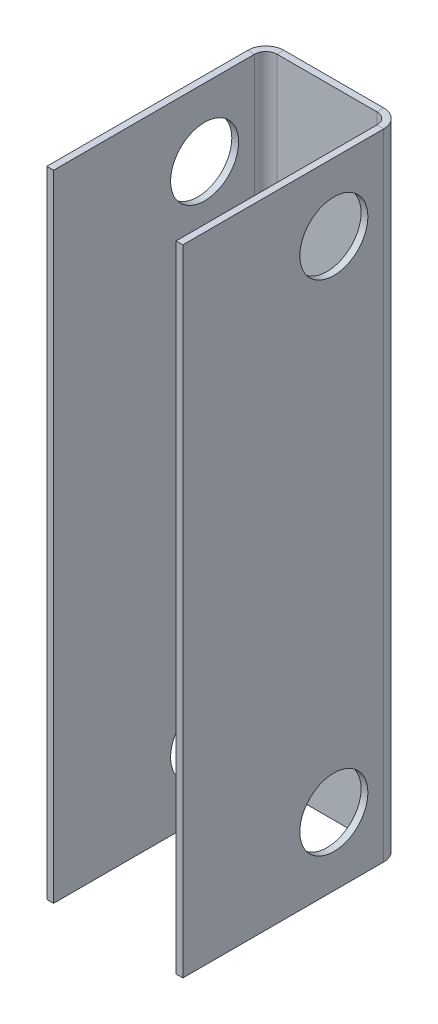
ISO-10303-21;
HEADER;
FILE_DESCRIPTION(('STEP AP214'),'2;1');
FILE_NAME('part.step','',(''),(''),'','','');
FILE_SCHEMA(('AUTOMOTIVE_DESIGN { 1 0 10303 214 1 1 1 1 }'));
ENDSEC;
DATA;
#1=APPLICATION_CONTEXT('core data for automotive mechanical design processes');
#2=APPLICATION_PROTOCOL_DEFINITION('international standard','automotive_design',2000,#1);
#3=PRODUCT_CONTEXT('',#1,'mechanical');
#4=PRODUCT('Part','Part','',(#3));
#5=PRODUCT_RELATED_PRODUCT_CATEGORY('part','',(#4));
#6=PRODUCT_DEFINITION_FORMATION('','',#4);
#7=PRODUCT_DEFINITION_CONTEXT('part definition',#1,'design');
#8=PRODUCT_DEFINITION('design','',#6,#7);
#9=PRODUCT_DEFINITION_SHAPE('','',#8);
#10=(LENGTH_UNIT() NAMED_UNIT(*) SI_UNIT(.MILLI.,.METRE.));
#11=(NAMED_UNIT(*) PLANE_ANGLE_UNIT() SI_UNIT($,.RADIAN.));
#12=(NAMED_UNIT(*) SI_UNIT($,.STERADIAN.) SOLID_ANGLE_UNIT());
#13=UNCERTAINTY_MEASURE_WITH_UNIT(LENGTH_MEASURE(1.E-05),#10,'distance_accuracy_value','');
#14=(GEOMETRIC_REPRESENTATION_CONTEXT(3) GLOBAL_UNCERTAINTY_ASSIGNED_CONTEXT((#13)) GLOBAL_UNIT_ASSIGNED_CONTEXT((#10,
#11,#12)) REPRESENTATION_CONTEXT('',''));
#15=CARTESIAN_POINT('',(0.,0.,0.));
#16=DIRECTION('',(0.,0.,1.));
#17=DIRECTION('',(1.,0.,0.));
#18=AXIS2_PLACEMENT_3D('',#15,#16,#17);
#19=CARTESIAN_POINT('',(0.,280.,0.));
#20=DIRECTION('',(0.,0.,-1.));
#21=DIRECTION('',(-1.,0.,0.));
#22=AXIS2_PLACEMENT_3D('',#19,#20,#21);
#23=PLANE('',#22);
#24=DIRECTION('',(-1.,0.,0.));
#25=VECTOR('',#24,1.);
#26=CARTESIAN_POINT('',(0.,280.,0.));
#27=LINE('',#26,#25);
#28=CARTESIAN_POINT('',(142.,280.,0.));
#29=VERTEX_POINT('',#28);
#30=CARTESIAN_POINT('',(98.,280.,6.85993171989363E-08));
#31=VERTEX_POINT('',#30);
#32=EDGE_CURVE('E58',#29,#31,#27,.T.);
#33=ORIENTED_EDGE('',*,*,#32,.F.);
#34=DIRECTION('',(0.,-1.,0.));
#35=VECTOR('',#34,1.);
#36=CARTESIAN_POINT('',(142.,280.,0.));
#37=LINE('',#36,#35);
#38=CARTESIAN_POINT('',(142.,0.,0.));
#39=VERTEX_POINT('',#38);
#40=EDGE_CURVE('E50',#29,#39,#37,.T.);
#41=ORIENTED_EDGE('',*,*,#40,.T.);
#42=DIRECTION('',(1.,0.,0.));
#43=VECTOR('',#42,1.);
#44=CARTESIAN_POINT('',(0.,0.,0.));
#45=LINE('',#44,#43);
#46=CARTESIAN_POINT('',(98.,0.,0.));
#47=VERTEX_POINT('',#46);
#48=EDGE_CURVE('E66',#47,#39,#45,.T.);
#49=ORIENTED_EDGE('',*,*,#48,.F.);
#50=DIRECTION('',(0.,-1.,0.));
#51=VECTOR('',#50,1.);
#52=CARTESIAN_POINT('',(98.,280.,0.));
#53=LINE('',#52,#51);
#54=EDGE_CURVE('E229',#31,#47,#53,.T.);
#55=ORIENTED_EDGE('',*,*,#54,.F.);
#56=EDGE_LOOP('',(#33,#41,#49,#55));
#57=FACE_BOUND('',#56,.T.);
#58=ADVANCED_FACE('F41',(#57),#23,.T.);
#59=CARTESIAN_POINT('',(0.,280.,3.));
#60=DIRECTION('',(0.,0.,-1.));
#61=DIRECTION('',(-1.,0.,0.));
#62=AXIS2_PLACEMENT_3D('',#59,#60,#61);
#63=PLANE('',#62);
#64=DIRECTION('',(0.,-1.,0.));
#65=VECTOR('',#64,1.);
#66=CARTESIAN_POINT('',(142.,280.,3.));
#67=LINE('',#66,#65);
#68=CARTESIAN_POINT('',(142.,280.,2.9999999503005));
#69=VERTEX_POINT('',#68);
#70=CARTESIAN_POINT('',(142.,0.,3.));
#71=VERTEX_POINT('',#70);
#72=EDGE_CURVE('E233',#69,#71,#67,.T.);
#73=ORIENTED_EDGE('',*,*,#72,.F.);
#74=DIRECTION('',(-1.,0.,0.));
#75=VECTOR('',#74,1.);
#76=CARTESIAN_POINT('',(0.,280.,3.));
#77=LINE('',#76,#75);
#78=CARTESIAN_POINT('',(98.,280.,3.00000003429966));
#79=VERTEX_POINT('',#78);
#80=EDGE_CURVE('E45',#69,#79,#77,.T.);
#81=ORIENTED_EDGE('',*,*,#80,.T.);
#82=DIRECTION('',(0.,-1.,0.));
#83=VECTOR('',#82,1.);
#84=CARTESIAN_POINT('',(98.,280.,3.));
#85=LINE('',#84,#83);
#86=CARTESIAN_POINT('',(98.,0.,3.00000003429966));
#87=VERTEX_POINT('',#86);
#88=EDGE_CURVE('E223',#79,#87,#85,.T.);
#89=ORIENTED_EDGE('',*,*,#88,.T.);
#90=DIRECTION('',(1.,0.,0.));
#91=VECTOR('',#90,1.);
#92=CARTESIAN_POINT('',(0.,0.,3.));
#93=LINE('',#92,#91);
#94=EDGE_CURVE('E241',#87,#71,#93,.T.);
#95=ORIENTED_EDGE('',*,*,#94,.T.);
#96=EDGE_LOOP('',(#73,#81,#89,#95));
#97=FACE_BOUND('',#96,.T.);
#98=ADVANCED_FACE('F246',(#97),#63,.F.);
#99=CARTESIAN_POINT('',(0.,280.,3.));
#100=DIRECTION('',(0.,-1.,0.));
#101=DIRECTION('',(0.,0.,-1.));
#102=AXIS2_PLACEMENT_3D('',#99,#100,#101);
#103=PLANE('',#102);
#104=DIRECTION('',(0.,0.,1.));
#105=VECTOR('',#104,1.);
#106=CARTESIAN_POINT('',(142.,280.,3.));
#107=LINE('',#106,#105);
#108=EDGE_CURVE('E12',#29,#69,#107,.T.);
#109=ORIENTED_EDGE('',*,*,#108,.F.);
#110=ORIENTED_EDGE('',*,*,#32,.T.);
#111=DIRECTION('',(0.,0.,1.));
#112=VECTOR('',#111,1.);
#113=CARTESIAN_POINT('',(98.,280.,3.));
#114=LINE('',#113,#112);
#115=EDGE_CURVE('E226',#31,#79,#114,.T.);
#116=ORIENTED_EDGE('',*,*,#115,.T.);
#117=ORIENTED_EDGE('',*,*,#80,.F.);
#118=EDGE_LOOP('',(#109,#110,#116,#117));
#119=FACE_BOUND('',#118,.T.);
#120=ADVANCED_FACE('F43',(#119),#103,.F.);
#121=CARTESIAN_POINT('',(0.,0.,3.));
#122=DIRECTION('',(0.,1.,0.));
#123=DIRECTION('',(0.,0.,1.));
#124=AXIS2_PLACEMENT_3D('',#121,#122,#123);
#125=PLANE('',#124);
#126=DIRECTION('',(0.,0.,-1.));
#127=VECTOR('',#126,1.);
#128=CARTESIAN_POINT('',(142.,0.,3.));
#129=LINE('',#128,#127);
#130=EDGE_CURVE('E236',#71,#39,#129,.T.);
#131=ORIENTED_EDGE('',*,*,#130,.F.);
#132=ORIENTED_EDGE('',*,*,#94,.F.);
#133=DIRECTION('',(0.,0.,-1.));
#134=VECTOR('',#133,1.);
#135=CARTESIAN_POINT('',(98.,0.,3.));
#136=LINE('',#135,#134);
#137=EDGE_CURVE('E231',#87,#47,#136,.T.);
#138=ORIENTED_EDGE('',*,*,#137,.T.);
#139=ORIENTED_EDGE('',*,*,#48,.T.);
#140=EDGE_LOOP('',(#131,#132,#138,#139));
#141=FACE_BOUND('',#140,.T.);
#142=ADVANCED_FACE('F287',(#141),#125,.F.);
#143=CARTESIAN_POINT('',(98.,280.,7.99999993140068));
#144=DIRECTION('',(0.,-1.,0.));
#145=DIRECTION('',(0.,0.,-1.));
#146=AXIS2_PLACEMENT_3D('',#143,#144,#145);
#147=PLANE('',#146);
#148=ORIENTED_EDGE('',*,*,#115,.F.);
#149=CARTESIAN_POINT('',(98.,280.,8.));
#150=DIRECTION('',(0.,-1.,0.));
#151=DIRECTION('',(1.,0.,0.));
#152=AXIS2_PLACEMENT_3D('',#149,#150,#151);
#153=CIRCLE('',#152,7.99999993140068);
#154=CARTESIAN_POINT('',(90.,280.,8.00000000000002));
#155=VERTEX_POINT('',#154);
#156=EDGE_CURVE('E181',#31,#155,#153,.F.);
#157=ORIENTED_EDGE('',*,*,#156,.T.);
#158=DIRECTION('',(1.,0.,0.));
#159=VECTOR('',#158,1.);
#160=CARTESIAN_POINT('',(93.,280.,8.00000000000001));
#161=LINE('',#160,#159);
#162=CARTESIAN_POINT('',(93.,280.,7.99999999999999));
#163=VERTEX_POINT('',#162);
#164=EDGE_CURVE('E204',#155,#163,#161,.T.);
#165=ORIENTED_EDGE('',*,*,#164,.T.);
#166=CARTESIAN_POINT('',(98.,280.,7.99999993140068));
#167=DIRECTION('',(0.,1.,0.));
#168=DIRECTION('',(0.,0.,1.));
#169=AXIS2_PLACEMENT_3D('',#166,#167,#168);
#170=CIRCLE('',#169,4.99999989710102);
#171=EDGE_CURVE('E215',#79,#163,#170,.T.);
#172=ORIENTED_EDGE('',*,*,#171,.F.);
#173=EDGE_LOOP('',(#148,#157,#165,#172));
#174=FACE_BOUND('',#173,.T.);
#175=ADVANCED_FACE('F251',(#174),#147,.F.);
#176=CARTESIAN_POINT('',(98.,0.,7.99999993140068));
#177=DIRECTION('',(0.,1.,0.));
#178=DIRECTION('',(-1.,0.,0.));
#179=AXIS2_PLACEMENT_3D('',#176,#177,#178);
#180=PLANE('',#179);
#181=DIRECTION('',(-1.,0.,0.));
#182=VECTOR('',#181,1.);
#183=CARTESIAN_POINT('',(93.,0.,8.00000000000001));
#184=LINE('',#183,#182);
#185=CARTESIAN_POINT('',(93.0000000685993,0.,8.00000000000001));
#186=VERTEX_POINT('',#185);
#187=CARTESIAN_POINT('',(90.,0.,8.00000000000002));
#188=VERTEX_POINT('',#187);
#189=EDGE_CURVE('E207',#186,#188,#184,.T.);
#190=ORIENTED_EDGE('',*,*,#189,.T.);
#191=CARTESIAN_POINT('',(98.,0.,8.));
#192=DIRECTION('',(0.,-1.,0.));
#193=DIRECTION('',(1.,0.,0.));
#194=AXIS2_PLACEMENT_3D('',#191,#192,#193);
#195=CIRCLE('',#194,7.99999993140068);
#196=EDGE_CURVE('E212',#188,#47,#195,.T.);
#197=ORIENTED_EDGE('',*,*,#196,.T.);
#198=ORIENTED_EDGE('',*,*,#137,.F.);
#199=CARTESIAN_POINT('',(98.,0.,7.99999993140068));
#200=DIRECTION('',(0.,-1.,0.));
#201=DIRECTION('',(1.,0.,0.));
#202=AXIS2_PLACEMENT_3D('',#199,#200,#201);
#203=CIRCLE('',#202,4.99999989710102);
#204=EDGE_CURVE('E220',#186,#87,#203,.T.);
#205=ORIENTED_EDGE('',*,*,#204,.F.);
#206=EDGE_LOOP('',(#190,#197,#198,#205));
#207=FACE_BOUND('',#206,.T.);
#208=ADVANCED_FACE('F262',(#207),#180,.F.);
#209=CARTESIAN_POINT('',(98.,420.174107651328,8.));
#210=DIRECTION('',(0.,-1.,0.));
#211=DIRECTION('',(1.,0.,0.));
#212=AXIS2_PLACEMENT_3D('',#209,#210,#211);
#213=CYLINDRICAL_SURFACE('',#212,4.99999993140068);
#214=ORIENTED_EDGE('',*,*,#204,.T.);
#215=ORIENTED_EDGE('',*,*,#88,.F.);
#216=ORIENTED_EDGE('',*,*,#171,.T.);
#217=DIRECTION('',(0.,-1.,0.));
#218=VECTOR('',#217,1.);
#219=CARTESIAN_POINT('',(93.,280.,8.00000000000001));
#220=LINE('',#219,#218);
#221=EDGE_CURVE('E178',#163,#186,#220,.T.);
#222=ORIENTED_EDGE('',*,*,#221,.T.);
#223=EDGE_LOOP('',(#214,#215,#216,#222));
#224=FACE_BOUND('',#223,.T.);
#225=ADVANCED_FACE('F271',(#224),#213,.F.);
#226=CARTESIAN_POINT('',(98.,420.174107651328,8.));
#227=DIRECTION('',(0.,-1.,0.));
#228=DIRECTION('',(1.,0.,0.));
#229=AXIS2_PLACEMENT_3D('',#226,#227,#228);
#230=CYLINDRICAL_SURFACE('',#229,7.99999993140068);
#231=ORIENTED_EDGE('',*,*,#196,.F.);
#232=DIRECTION('',(0.,-1.,0.));
#233=VECTOR('',#232,1.);
#234=CARTESIAN_POINT('',(90.,280.,8.00000000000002));
#235=LINE('',#234,#233);
#236=EDGE_CURVE('E185',#155,#188,#235,.T.);
#237=ORIENTED_EDGE('',*,*,#236,.F.);
#238=ORIENTED_EDGE('',*,*,#156,.F.);
#239=ORIENTED_EDGE('',*,*,#54,.T.);
#240=EDGE_LOOP('',(#231,#237,#238,#239));
#241=FACE_BOUND('',#240,.T.);
#242=ADVANCED_FACE('F255',(#241),#230,.T.);
#243=CARTESIAN_POINT('',(93.0000000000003,0.,96.5909300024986));
#244=DIRECTION('',(0.,0.,-1.));
#245=DIRECTION('',(-1.,0.,0.));
#246=AXIS2_PLACEMENT_3D('',#243,#244,#245);
#247=PLANE('',#246);
#248=DIRECTION('',(0.,-1.,0.));
#249=VECTOR('',#248,1.);
#250=CARTESIAN_POINT('',(90.0000000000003,0.,96.5909300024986));
#251=LINE('',#250,#249);
#252=CARTESIAN_POINT('',(90.0000000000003,280.,96.5909300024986));
#253=VERTEX_POINT('',#252);
#254=CARTESIAN_POINT('',(90.0000000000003,0.,96.5909300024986));
#255=VERTEX_POINT('',#254);
#256=EDGE_CURVE('E201',#253,#255,#251,.T.);
#257=ORIENTED_EDGE('',*,*,#256,.T.);
#258=DIRECTION('',(-1.,0.,0.));
#259=VECTOR('',#258,1.);
#260=CARTESIAN_POINT('',(93.0000000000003,0.,96.5909300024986));
#261=LINE('',#260,#259);
#262=CARTESIAN_POINT('',(93.0000000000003,0.,96.5909300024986));
#263=VERTEX_POINT('',#262);
#264=EDGE_CURVE('E182',#263,#255,#261,.T.);
#265=ORIENTED_EDGE('',*,*,#264,.F.);
#266=DIRECTION('',(0.,-1.,0.));
#267=VECTOR('',#266,1.);
#268=CARTESIAN_POINT('',(93.0000000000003,0.,96.5909300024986));
#269=LINE('',#268,#267);
#270=CARTESIAN_POINT('',(93.0000000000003,280.,96.5909300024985));
#271=VERTEX_POINT('',#270);
#272=EDGE_CURVE('E193',#271,#263,#269,.T.);
#273=ORIENTED_EDGE('',*,*,#272,.F.);
#274=DIRECTION('',(-1.,0.,0.));
#275=VECTOR('',#274,1.);
#276=CARTESIAN_POINT('',(93.0000000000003,280.,96.5909300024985));
#277=LINE('',#276,#275);
#278=EDGE_CURVE('E198',#271,#253,#277,.T.);
#279=ORIENTED_EDGE('',*,*,#278,.T.);
#280=EDGE_LOOP('',(#257,#265,#273,#279));
#281=FACE_BOUND('',#280,.T.);
#282=ADVANCED_FACE('F278',(#281),#247,.F.);
#283=CARTESIAN_POINT('',(93.0000000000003,280.,96.5909300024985));
#284=DIRECTION('',(-1.,0.,0.));
#285=DIRECTION('',(0.,0.,1.));
#286=AXIS2_PLACEMENT_3D('',#283,#284,#285);
#287=PLANE('',#286);
#288=CARTESIAN_POINT('',(93.,250.,29.9999999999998));
#289=DIRECTION('',(-1.,0.,0.));
#290=DIRECTION('',(0.,0.,1.));
#291=AXIS2_PLACEMENT_3D('',#288,#289,#290);
#292=CIRCLE('',#291,15.);
#293=CARTESIAN_POINT('',(93.0000000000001,250.,44.9999999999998));
#294=VERTEX_POINT('',#293);
#295=EDGE_CURVE('E512',#294,#294,#292,.T.);
#296=ORIENTED_EDGE('',*,*,#295,.T.);
#297=EDGE_LOOP('',(#296));
#298=FACE_BOUND('',#297,.T.);
#299=CARTESIAN_POINT('',(93.0000000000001,30.,29.9999999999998));
#300=DIRECTION('',(-1.,0.,0.));
#301=DIRECTION('',(0.,0.,1.));
#302=AXIS2_PLACEMENT_3D('',#299,#300,#301);
#303=CIRCLE('',#302,15.);
#304=CARTESIAN_POINT('',(93.0000000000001,30.,44.9999999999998));
#305=VERTEX_POINT('',#304);
#306=EDGE_CURVE('E161',#305,#305,#303,.T.);
#307=ORIENTED_EDGE('',*,*,#306,.T.);
#308=EDGE_LOOP('',(#307));
#309=FACE_BOUND('',#308,.T.);
#310=ORIENTED_EDGE('',*,*,#221,.F.);
#311=DIRECTION('',(0.,0.,1.));
#312=VECTOR('',#311,1.);
#313=CARTESIAN_POINT('',(93.0000000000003,280.,96.5909300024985));
#314=LINE('',#313,#312);
#315=EDGE_CURVE('E196',#163,#271,#314,.T.);
#316=ORIENTED_EDGE('',*,*,#315,.T.);
#317=ORIENTED_EDGE('',*,*,#272,.T.);
#318=DIRECTION('',(0.,0.,-1.));
#319=VECTOR('',#318,1.);
#320=CARTESIAN_POINT('',(93.0000000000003,0.,96.5909300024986));
#321=LINE('',#320,#319);
#322=EDGE_CURVE('E190',#263,#186,#321,.T.);
#323=ORIENTED_EDGE('',*,*,#322,.T.);
#324=EDGE_LOOP('',(#310,#316,#317,#323));
#325=FACE_BOUND('',#324,.T.);
#326=ADVANCED_FACE('F266',(#298,#309,#325),#287,.F.);
#327=CARTESIAN_POINT('',(93.0000000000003,280.,96.5909300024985));
#328=DIRECTION('',(0.,-1.,0.));
#329=DIRECTION('',(-1.,0.,0.));
#330=AXIS2_PLACEMENT_3D('',#327,#328,#329);
#331=PLANE('',#330);
#332=ORIENTED_EDGE('',*,*,#164,.F.);
#333=DIRECTION('',(0.,0.,1.));
#334=VECTOR('',#333,1.);
#335=CARTESIAN_POINT('',(90.0000000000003,280.,96.5909300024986));
#336=LINE('',#335,#334);
#337=EDGE_CURVE('E188',#155,#253,#336,.T.);
#338=ORIENTED_EDGE('',*,*,#337,.T.);
#339=ORIENTED_EDGE('',*,*,#278,.F.);
#340=ORIENTED_EDGE('',*,*,#315,.F.);
#341=EDGE_LOOP('',(#332,#338,#339,#340));
#342=FACE_BOUND('',#341,.T.);
#343=ADVANCED_FACE('F332',(#342),#331,.F.);
#344=CARTESIAN_POINT('',(90.0000000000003,280.,96.5909300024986));
#345=DIRECTION('',(-1.,0.,0.));
#346=DIRECTION('',(0.,0.,1.));
#347=AXIS2_PLACEMENT_3D('',#344,#345,#346);
#348=PLANE('',#347);
#349=CARTESIAN_POINT('',(89.9999999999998,250.,29.9999999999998));
#350=DIRECTION('',(1.,0.,0.));
#351=DIRECTION('',(0.,0.,-1.));
#352=AXIS2_PLACEMENT_3D('',#349,#350,#351);
#353=CIRCLE('',#352,15.);
#354=CARTESIAN_POINT('',(89.9999999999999,250.,14.9999999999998));
#355=VERTEX_POINT('',#354);
#356=EDGE_CURVE('E509',#355,#355,#353,.T.);
#357=ORIENTED_EDGE('',*,*,#356,.T.);
#358=EDGE_LOOP('',(#357));
#359=FACE_BOUND('',#358,.T.);
#360=CARTESIAN_POINT('',(89.9999999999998,30.,29.9999999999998));
#361=DIRECTION('',(1.,0.,0.));
#362=DIRECTION('',(0.,0.,-1.));
#363=AXIS2_PLACEMENT_3D('',#360,#361,#362);
#364=CIRCLE('',#363,15.);
#365=CARTESIAN_POINT('',(89.9999999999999,30.,14.9999999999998));
#366=VERTEX_POINT('',#365);
#367=EDGE_CURVE('E517',#366,#366,#364,.T.);
#368=ORIENTED_EDGE('',*,*,#367,.T.);
#369=EDGE_LOOP('',(#368));
#370=FACE_BOUND('',#369,.T.);
#371=ORIENTED_EDGE('',*,*,#337,.F.);
#372=ORIENTED_EDGE('',*,*,#236,.T.);
#373=DIRECTION('',(0.,0.,-1.));
#374=VECTOR('',#373,1.);
#375=CARTESIAN_POINT('',(90.0000000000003,0.,96.5909300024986));
#376=LINE('',#375,#374);
#377=EDGE_CURVE('E179',#255,#188,#376,.T.);
#378=ORIENTED_EDGE('',*,*,#377,.F.);
#379=ORIENTED_EDGE('',*,*,#256,.F.);
#380=EDGE_LOOP('',(#371,#372,#378,#379));
#381=FACE_BOUND('',#380,.T.);
#382=ADVANCED_FACE('F257',(#359,#370,#381),#348,.T.);
#383=CARTESIAN_POINT('',(93.0000000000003,0.,96.5909300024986));
#384=DIRECTION('',(0.,1.,0.));
#385=DIRECTION('',(1.,0.,0.));
#386=AXIS2_PLACEMENT_3D('',#383,#384,#385);
#387=PLANE('',#386);
#388=ORIENTED_EDGE('',*,*,#189,.F.);
#389=ORIENTED_EDGE('',*,*,#322,.F.);
#390=ORIENTED_EDGE('',*,*,#264,.T.);
#391=ORIENTED_EDGE('',*,*,#377,.T.);
#392=EDGE_LOOP('',(#388,#389,#390,#391));
#393=FACE_BOUND('',#392,.T.);
#394=ADVANCED_FACE('F264',(#393),#387,.F.);
#395=CARTESIAN_POINT('',(142.,280.,8.00000009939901));
#396=DIRECTION('',(0.,-1.,0.));
#397=DIRECTION('',(0.,0.,-1.));
#398=AXIS2_PLACEMENT_3D('',#395,#396,#397);
#399=PLANE('',#398);
#400=DIRECTION('',(-1.,0.,0.));
#401=VECTOR('',#400,1.);
#402=CARTESIAN_POINT('',(147.,280.,8.00000000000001));
#403=LINE('',#402,#401);
#404=CARTESIAN_POINT('',(150.,280.,8.00000000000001));
#405=VERTEX_POINT('',#404);
#406=CARTESIAN_POINT('',(147.000000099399,280.,8.00000000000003));
#407=VERTEX_POINT('',#406);
#408=EDGE_CURVE('E531',#405,#407,#403,.T.);
#409=ORIENTED_EDGE('',*,*,#408,.F.);
#410=CARTESIAN_POINT('',(142.,280.,8.));
#411=DIRECTION('',(0.,1.,0.));
#412=DIRECTION('',(-1.,0.,0.));
#413=AXIS2_PLACEMENT_3D('',#410,#411,#412);
#414=CIRCLE('',#413,8.00000009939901);
#415=EDGE_CURVE('E165',#405,#29,#414,.T.);
#416=ORIENTED_EDGE('',*,*,#415,.T.);
#417=ORIENTED_EDGE('',*,*,#108,.T.);
#418=CARTESIAN_POINT('',(142.,280.,8.00000009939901));
#419=DIRECTION('',(0.,1.,0.));
#420=DIRECTION('',(0.,0.,1.));
#421=AXIS2_PLACEMENT_3D('',#418,#419,#420);
#422=CIRCLE('',#421,5.00000014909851);
#423=EDGE_CURVE('E172',#407,#69,#422,.T.);
#424=ORIENTED_EDGE('',*,*,#423,.F.);
#425=EDGE_LOOP('',(#409,#416,#417,#424));
#426=FACE_BOUND('',#425,.T.);
#427=ADVANCED_FACE('F347',(#426),#399,.F.);
#428=CARTESIAN_POINT('',(142.,0.,8.00000009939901));
#429=DIRECTION('',(0.,1.,0.));
#430=DIRECTION('',(-1.,0.,0.));
#431=AXIS2_PLACEMENT_3D('',#428,#429,#430);
#432=PLANE('',#431);
#433=CARTESIAN_POINT('',(142.,0.,8.));
#434=DIRECTION('',(0.,1.,0.));
#435=DIRECTION('',(-1.,0.,0.));
#436=AXIS2_PLACEMENT_3D('',#433,#434,#435);
#437=CIRCLE('',#436,8.00000009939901);
#438=CARTESIAN_POINT('',(150.,0.,7.99999999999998));
#439=VERTEX_POINT('',#438);
#440=EDGE_CURVE('E168',#39,#439,#437,.F.);
#441=ORIENTED_EDGE('',*,*,#440,.T.);
#442=DIRECTION('',(1.,0.,0.));
#443=VECTOR('',#442,1.);
#444=CARTESIAN_POINT('',(147.,0.,8.00000000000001));
#445=LINE('',#444,#443);
#446=CARTESIAN_POINT('',(147.,0.,7.99999999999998));
#447=VERTEX_POINT('',#446);
#448=EDGE_CURVE('E142',#447,#439,#445,.T.);
#449=ORIENTED_EDGE('',*,*,#448,.F.);
#450=CARTESIAN_POINT('',(142.,0.,8.00000009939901));
#451=DIRECTION('',(0.,-1.,0.));
#452=DIRECTION('',(1.,0.,0.));
#453=AXIS2_PLACEMENT_3D('',#450,#451,#452);
#454=CIRCLE('',#453,5.00000014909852);
#455=EDGE_CURVE('E175',#71,#447,#454,.T.);
#456=ORIENTED_EDGE('',*,*,#455,.F.);
#457=ORIENTED_EDGE('',*,*,#130,.T.);
#458=EDGE_LOOP('',(#441,#449,#456,#457));
#459=FACE_BOUND('',#458,.T.);
#460=ADVANCED_FACE('F358',(#459),#432,.F.);
#461=CARTESIAN_POINT('',(142.,-140.174107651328,8.));
#462=DIRECTION('',(0.,1.,0.));
#463=DIRECTION('',(-1.,0.,0.));
#464=AXIS2_PLACEMENT_3D('',#461,#462,#463);
#465=CYLINDRICAL_SURFACE('',#464,5.00000009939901);
#466=ORIENTED_EDGE('',*,*,#72,.T.);
#467=ORIENTED_EDGE('',*,*,#455,.T.);
#468=DIRECTION('',(0.,-1.,0.));
#469=VECTOR('',#468,1.);
#470=CARTESIAN_POINT('',(147.,280.,8.00000000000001));
#471=LINE('',#470,#469);
#472=EDGE_CURVE('E538',#407,#447,#471,.T.);
#473=ORIENTED_EDGE('',*,*,#472,.F.);
#474=ORIENTED_EDGE('',*,*,#423,.T.);
#475=EDGE_LOOP('',(#466,#467,#473,#474));
#476=FACE_BOUND('',#475,.T.);
#477=ADVANCED_FACE('F361',(#476),#465,.F.);
#478=CARTESIAN_POINT('',(142.,-140.174107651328,8.));
#479=DIRECTION('',(0.,1.,0.));
#480=DIRECTION('',(-1.,0.,0.));
#481=AXIS2_PLACEMENT_3D('',#478,#479,#480);
#482=CYLINDRICAL_SURFACE('',#481,8.00000009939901);
#483=ORIENTED_EDGE('',*,*,#40,.F.);
#484=ORIENTED_EDGE('',*,*,#415,.F.);
#485=DIRECTION('',(0.,-1.,0.));
#486=VECTOR('',#485,1.);
#487=CARTESIAN_POINT('',(150.,280.,8.00000000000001));
#488=LINE('',#487,#486);
#489=EDGE_CURVE('E159',#405,#439,#488,.T.);
#490=ORIENTED_EDGE('',*,*,#489,.T.);
#491=ORIENTED_EDGE('',*,*,#440,.F.);
#492=EDGE_LOOP('',(#483,#484,#490,#491));
#493=FACE_BOUND('',#492,.T.);
#494=ADVANCED_FACE('F373',(#493),#482,.T.);
#495=CARTESIAN_POINT('',(147.,0.,96.5909300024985));
#496=DIRECTION('',(0.,0.,-1.));
#497=DIRECTION('',(-1.,0.,0.));
#498=AXIS2_PLACEMENT_3D('',#495,#496,#497);
#499=PLANE('',#498);
#500=DIRECTION('',(0.,1.,0.));
#501=VECTOR('',#500,1.);
#502=CARTESIAN_POINT('',(150.,0.,96.5909300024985));
#503=LINE('',#502,#501);
#504=CARTESIAN_POINT('',(150.,0.,96.5909300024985));
#505=VERTEX_POINT('',#504);
#506=CARTESIAN_POINT('',(150.,280.,96.5909300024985));
#507=VERTEX_POINT('',#506);
#508=EDGE_CURVE('E152',#505,#507,#503,.T.);
#509=ORIENTED_EDGE('',*,*,#508,.T.);
#510=DIRECTION('',(1.,0.,0.));
#511=VECTOR('',#510,1.);
#512=CARTESIAN_POINT('',(147.,280.,96.5909300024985));
#513=LINE('',#512,#511);
#514=CARTESIAN_POINT('',(147.,280.,96.5909300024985));
#515=VERTEX_POINT('',#514);
#516=EDGE_CURVE('E169',#515,#507,#513,.T.);
#517=ORIENTED_EDGE('',*,*,#516,.F.);
#518=DIRECTION('',(0.,1.,0.));
#519=VECTOR('',#518,1.);
#520=CARTESIAN_POINT('',(147.,0.,96.5909300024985));
#521=LINE('',#520,#519);
#522=CARTESIAN_POINT('',(147.,0.,96.5909300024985));
#523=VERTEX_POINT('',#522);
#524=EDGE_CURVE('E154',#523,#515,#521,.T.);
#525=ORIENTED_EDGE('',*,*,#524,.F.);
#526=DIRECTION('',(1.,0.,0.));
#527=VECTOR('',#526,1.);
#528=CARTESIAN_POINT('',(147.,0.,96.5909300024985));
#529=LINE('',#528,#527);
#530=EDGE_CURVE('E139',#523,#505,#529,.T.);
#531=ORIENTED_EDGE('',*,*,#530,.T.);
#532=EDGE_LOOP('',(#509,#517,#525,#531));
#533=FACE_BOUND('',#532,.T.);
#534=ADVANCED_FACE('F150',(#533),#499,.F.);
#535=CARTESIAN_POINT('',(147.000000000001,280.,-143.409069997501));
#536=DIRECTION('',(1.,0.,0.));
#537=DIRECTION('',(0.,0.,-1.));
#538=AXIS2_PLACEMENT_3D('',#535,#536,#537);
#539=PLANE('',#538);
#540=CARTESIAN_POINT('',(147.,250.,30.));
#541=DIRECTION('',(1.,0.,0.));
#542=DIRECTION('',(0.,0.,-1.));
#543=AXIS2_PLACEMENT_3D('',#540,#541,#542);
#544=CIRCLE('',#543,15.);
#545=CARTESIAN_POINT('',(147.,250.,15.));
#546=VERTEX_POINT('',#545);
#547=EDGE_CURVE('E514',#546,#546,#544,.T.);
#548=ORIENTED_EDGE('',*,*,#547,.T.);
#549=EDGE_LOOP('',(#548));
#550=FACE_BOUND('',#549,.T.);
#551=CARTESIAN_POINT('',(147.,30.,30.));
#552=DIRECTION('',(1.,0.,0.));
#553=DIRECTION('',(0.,0.,-1.));
#554=AXIS2_PLACEMENT_3D('',#551,#552,#553);
#555=CIRCLE('',#554,15.);
#556=CARTESIAN_POINT('',(147.,30.,15.));
#557=VERTEX_POINT('',#556);
#558=EDGE_CURVE('E525',#557,#557,#555,.T.);
#559=ORIENTED_EDGE('',*,*,#558,.T.);
#560=EDGE_LOOP('',(#559));
#561=FACE_BOUND('',#560,.T.);
#562=DIRECTION('',(0.,0.,-1.));
#563=VECTOR('',#562,1.);
#564=CARTESIAN_POINT('',(147.000000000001,280.,-143.409069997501));
#565=LINE('',#564,#563);
#566=EDGE_CURVE('E155',#515,#407,#565,.T.);
#567=ORIENTED_EDGE('',*,*,#566,.T.);
#568=ORIENTED_EDGE('',*,*,#472,.T.);
#569=DIRECTION('',(0.,0.,1.));
#570=VECTOR('',#569,1.);
#571=CARTESIAN_POINT('',(147.000000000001,0.,-143.409069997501));
#572=LINE('',#571,#570);
#573=EDGE_CURVE('E536',#447,#523,#572,.T.);
#574=ORIENTED_EDGE('',*,*,#573,.T.);
#575=ORIENTED_EDGE('',*,*,#524,.T.);
#576=EDGE_LOOP('',(#567,#568,#574,#575));
#577=FACE_BOUND('',#576,.T.);
#578=ADVANCED_FACE('F402',(#550,#561,#577),#539,.F.);
#579=CARTESIAN_POINT('',(147.000000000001,0.,-143.409069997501));
#580=DIRECTION('',(0.,1.,0.));
#581=DIRECTION('',(-1.,0.,0.));
#582=AXIS2_PLACEMENT_3D('',#579,#580,#581);
#583=PLANE('',#582);
#584=ORIENTED_EDGE('',*,*,#573,.F.);
#585=ORIENTED_EDGE('',*,*,#448,.T.);
#586=DIRECTION('',(0.,0.,1.));
#587=VECTOR('',#586,1.);
#588=CARTESIAN_POINT('',(150.000000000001,0.,-143.409069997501));
#589=LINE('',#588,#587);
#590=EDGE_CURVE('E135',#439,#505,#589,.T.);
#591=ORIENTED_EDGE('',*,*,#590,.T.);
#592=ORIENTED_EDGE('',*,*,#530,.F.);
#593=EDGE_LOOP('',(#584,#585,#591,#592));
#594=FACE_BOUND('',#593,.T.);
#595=ADVANCED_FACE('F138',(#594),#583,.F.);
#596=CARTESIAN_POINT('',(150.000000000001,280.,-143.409069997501));
#597=DIRECTION('',(1.,0.,0.));
#598=DIRECTION('',(0.,0.,-1.));
#599=AXIS2_PLACEMENT_3D('',#596,#597,#598);
#600=PLANE('',#599);
#601=CARTESIAN_POINT('',(150.,250.,30.));
#602=DIRECTION('',(1.,0.,0.));
#603=DIRECTION('',(0.,0.,-1.));
#604=AXIS2_PLACEMENT_3D('',#601,#602,#603);
#605=CIRCLE('',#604,15.);
#606=CARTESIAN_POINT('',(150.,250.,15.));
#607=VERTEX_POINT('',#606);
#608=EDGE_CURVE('E558',#607,#607,#605,.T.);
#609=ORIENTED_EDGE('',*,*,#608,.F.);
#610=EDGE_LOOP('',(#609));
#611=FACE_BOUND('',#610,.T.);
#612=CARTESIAN_POINT('',(150.,30.,30.));
#613=DIRECTION('',(1.,0.,0.));
#614=DIRECTION('',(0.,0.,-1.));
#615=AXIS2_PLACEMENT_3D('',#612,#613,#614);
#616=CIRCLE('',#615,15.);
#617=CARTESIAN_POINT('',(150.,30.,15.));
#618=VERTEX_POINT('',#617);
#619=EDGE_CURVE('E513',#618,#618,#616,.T.);
#620=ORIENTED_EDGE('',*,*,#619,.F.);
#621=EDGE_LOOP('',(#620));
#622=FACE_BOUND('',#621,.T.);
#623=ORIENTED_EDGE('',*,*,#489,.F.);
#624=DIRECTION('',(0.,0.,-1.));
#625=VECTOR('',#624,1.);
#626=CARTESIAN_POINT('',(150.000000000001,280.,-143.409069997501));
#627=LINE('',#626,#625);
#628=EDGE_CURVE('E147',#507,#405,#627,.T.);
#629=ORIENTED_EDGE('',*,*,#628,.F.);
#630=ORIENTED_EDGE('',*,*,#508,.F.);
#631=ORIENTED_EDGE('',*,*,#590,.F.);
#632=EDGE_LOOP('',(#623,#629,#630,#631));
#633=FACE_BOUND('',#632,.T.);
#634=ADVANCED_FACE('F158',(#611,#622,#633),#600,.T.);
#635=CARTESIAN_POINT('',(147.000000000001,280.,-143.409069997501));
#636=DIRECTION('',(0.,-1.,0.));
#637=DIRECTION('',(1.,0.,0.));
#638=AXIS2_PLACEMENT_3D('',#635,#636,#637);
#639=PLANE('',#638);
#640=ORIENTED_EDGE('',*,*,#628,.T.);
#641=ORIENTED_EDGE('',*,*,#408,.T.);
#642=ORIENTED_EDGE('',*,*,#566,.F.);
#643=ORIENTED_EDGE('',*,*,#516,.T.);
#644=EDGE_LOOP('',(#640,#641,#642,#643));
#645=FACE_BOUND('',#644,.T.);
#646=ADVANCED_FACE('F420',(#645),#639,.F.);
#647=CARTESIAN_POINT('',(89.9999999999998,30.,29.9999999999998));
#648=DIRECTION('',(1.,0.,0.));
#649=DIRECTION('',(0.,0.,-1.));
#650=AXIS2_PLACEMENT_3D('',#647,#648,#649);
#651=CYLINDRICAL_SURFACE('',#650,15.);
#652=ORIENTED_EDGE('',*,*,#619,.T.);
#653=EDGE_LOOP('',(#652));
#654=FACE_BOUND('',#653,.T.);
#655=ORIENTED_EDGE('',*,*,#558,.F.);
#656=EDGE_LOOP('',(#655));
#657=FACE_BOUND('',#656,.T.);
#658=ADVANCED_FACE('F425',(#654,#657),#651,.F.);
#659=ORIENTED_EDGE('',*,*,#367,.F.);
#660=EDGE_LOOP('',(#659));
#661=FACE_BOUND('',#660,.T.);
#662=ORIENTED_EDGE('',*,*,#306,.F.);
#663=EDGE_LOOP('',(#662));
#664=FACE_BOUND('',#663,.T.);
#665=ADVANCED_FACE('F467',(#661,#664),#651,.F.);
#666=CARTESIAN_POINT('',(89.9999999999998,250.,29.9999999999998));
#667=DIRECTION('',(1.,0.,0.));
#668=DIRECTION('',(0.,0.,-1.));
#669=AXIS2_PLACEMENT_3D('',#666,#667,#668);
#670=CYLINDRICAL_SURFACE('',#669,15.);
#671=ORIENTED_EDGE('',*,*,#608,.T.);
#672=EDGE_LOOP('',(#671));
#673=FACE_BOUND('',#672,.T.);
#674=ORIENTED_EDGE('',*,*,#547,.F.);
#675=EDGE_LOOP('',(#674));
#676=FACE_BOUND('',#675,.T.);
#677=ADVANCED_FACE('F477',(#673,#676),#670,.F.);
#678=ORIENTED_EDGE('',*,*,#356,.F.);
#679=EDGE_LOOP('',(#678));
#680=FACE_BOUND('',#679,.T.);
#681=ORIENTED_EDGE('',*,*,#295,.F.);
#682=EDGE_LOOP('',(#681));
#683=FACE_BOUND('',#682,.T.);
#684=ADVANCED_FACE('F487',(#680,#683),#670,.F.);
#685=CLOSED_SHELL('',(#58,#98,#120,#142,#175,#208,#225,#242,#282,#326,#343,#382,#394,#427,#460,
#477,#494,#534,#578,#595,#634,#646,#658,#665,#677,#684));
#686=MANIFOLD_SOLID_BREP('B2',#685);
#687=ADVANCED_BREP_SHAPE_REPRESENTATION('',(#18,#686),#14);
#688=SHAPE_DEFINITION_REPRESENTATION(#9,#687);
ENDSEC;
END-ISO-10303-21;
